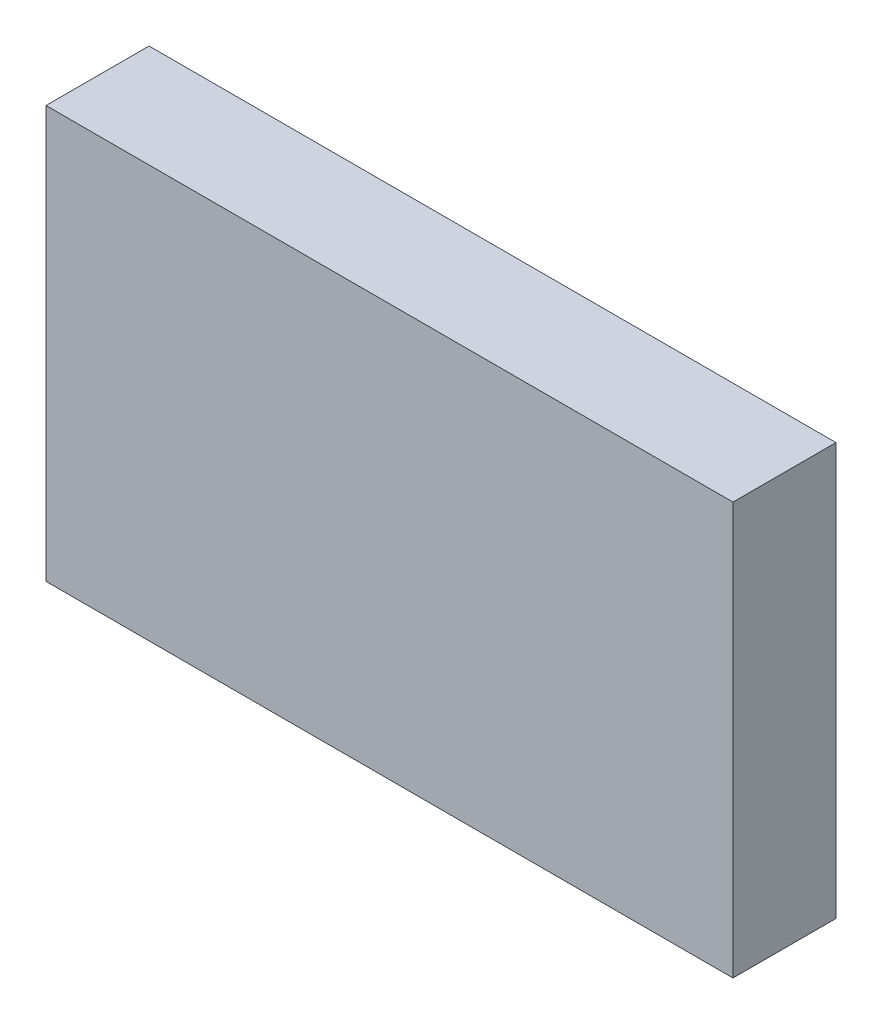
from build123d import *

# Parameters (mm, degrees)
ESQUISSE1_W          = 100
ESQUISSE1_H          = 60
BASE_EXTRUSION_DEPTH = 15


with BuildPart() as part:
    # Esquisse1 → Base-Extrusion (new body)
    with BuildSketch(Plane.XY):
        with Locations((50, -30)):
            Rectangle(ESQUISSE1_W, ESQUISSE1_H)
    extrude(amount=BASE_EXTRUSION_DEPTH)


solid = part.part
